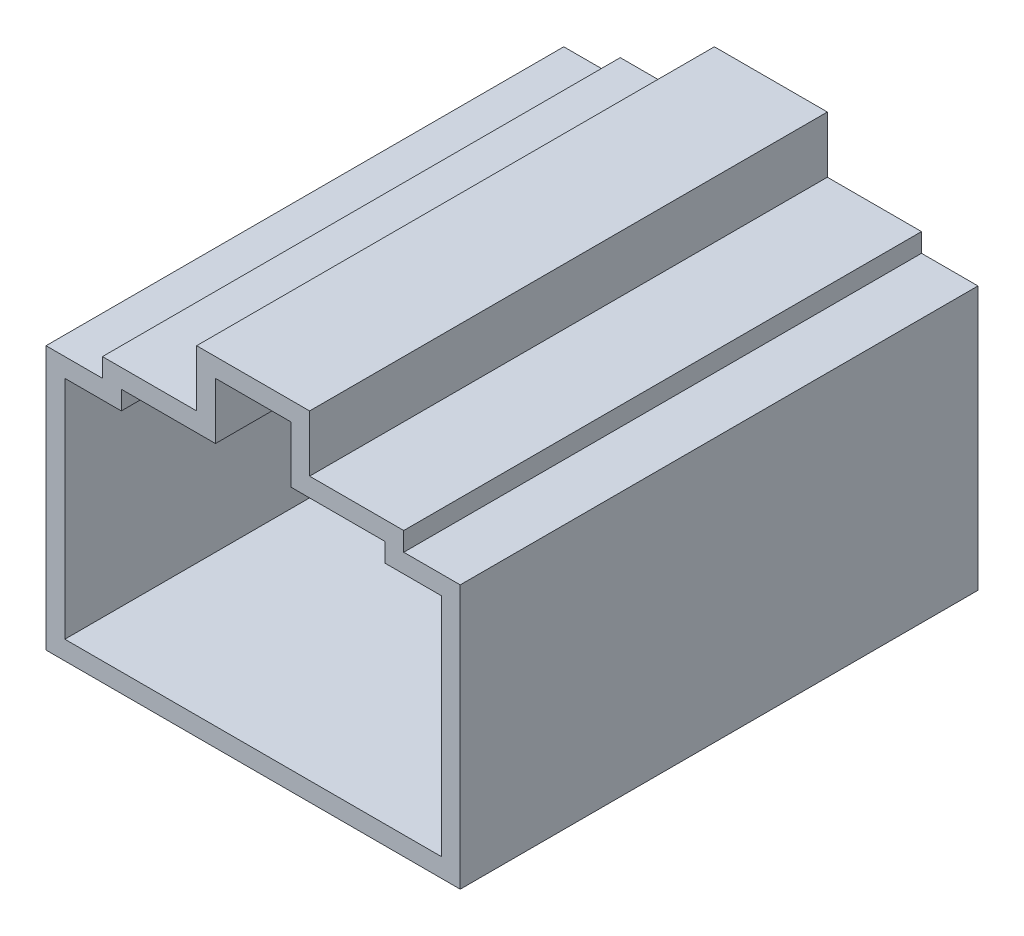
ISO-10303-21;
HEADER;
FILE_DESCRIPTION(('STEP AP214'),'2;1');
FILE_NAME('part.step','',(''),(''),'','','');
FILE_SCHEMA(('AUTOMOTIVE_DESIGN { 1 0 10303 214 1 1 1 1 }'));
ENDSEC;
DATA;
#1=APPLICATION_CONTEXT('core data for automotive mechanical design processes');
#2=APPLICATION_PROTOCOL_DEFINITION('international standard','automotive_design',2000,#1);
#3=PRODUCT_CONTEXT('',#1,'mechanical');
#4=PRODUCT('Part','Part','',(#3));
#5=PRODUCT_RELATED_PRODUCT_CATEGORY('part','',(#4));
#6=PRODUCT_DEFINITION_FORMATION('','',#4);
#7=PRODUCT_DEFINITION_CONTEXT('part definition',#1,'design');
#8=PRODUCT_DEFINITION('design','',#6,#7);
#9=PRODUCT_DEFINITION_SHAPE('','',#8);
#10=(LENGTH_UNIT() NAMED_UNIT(*) SI_UNIT(.MILLI.,.METRE.));
#11=(NAMED_UNIT(*) PLANE_ANGLE_UNIT() SI_UNIT($,.RADIAN.));
#12=(NAMED_UNIT(*) SI_UNIT($,.STERADIAN.) SOLID_ANGLE_UNIT());
#13=UNCERTAINTY_MEASURE_WITH_UNIT(LENGTH_MEASURE(1.E-05),#10,'distance_accuracy_value','');
#14=(GEOMETRIC_REPRESENTATION_CONTEXT(3) GLOBAL_UNCERTAINTY_ASSIGNED_CONTEXT((#13)) GLOBAL_UNIT_ASSIGNED_CONTEXT((#10,
#11,#12)) REPRESENTATION_CONTEXT('',''));
#15=CARTESIAN_POINT('',(0.,0.,0.));
#16=DIRECTION('',(0.,0.,1.));
#17=DIRECTION('',(1.,0.,0.));
#18=AXIS2_PLACEMENT_3D('',#15,#16,#17);
#19=CARTESIAN_POINT('',(0.,0.,27.5));
#20=DIRECTION('',(0.,0.,-1.));
#21=DIRECTION('',(-1.,0.,0.));
#22=AXIS2_PLACEMENT_3D('',#19,#20,#21);
#23=PLANE('',#22);
#24=DIRECTION('',(0.,-1.,0.));
#25=VECTOR('',#24,1.);
#26=CARTESIAN_POINT('',(-12.25,-11.1212765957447,27.5));
#27=LINE('',#26,#25);
#28=CARTESIAN_POINT('',(-12.25,2.87872340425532,27.5));
#29=VERTEX_POINT('',#28);
#30=CARTESIAN_POINT('',(-12.25,-11.1212765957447,27.5));
#31=VERTEX_POINT('',#30);
#32=EDGE_CURVE('E287',#29,#31,#27,.T.);
#33=ORIENTED_EDGE('',*,*,#32,.T.);
#34=DIRECTION('',(1.,0.,0.));
#35=VECTOR('',#34,1.);
#36=CARTESIAN_POINT('',(9.75,-11.1212765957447,27.5));
#37=LINE('',#36,#35);
#38=CARTESIAN_POINT('',(9.75,-11.1212765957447,27.5));
#39=VERTEX_POINT('',#38);
#40=EDGE_CURVE('E290',#31,#39,#37,.T.);
#41=ORIENTED_EDGE('',*,*,#40,.T.);
#42=DIRECTION('',(0.,1.,0.));
#43=VECTOR('',#42,1.);
#44=CARTESIAN_POINT('',(9.75,-11.1212765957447,27.5));
#45=LINE('',#44,#43);
#46=CARTESIAN_POINT('',(9.75,2.87872340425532,27.5));
#47=VERTEX_POINT('',#46);
#48=EDGE_CURVE('E293',#39,#47,#45,.T.);
#49=ORIENTED_EDGE('',*,*,#48,.T.);
#50=DIRECTION('',(-1.,0.,0.));
#51=VECTOR('',#50,1.);
#52=CARTESIAN_POINT('',(9.75,2.87872340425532,27.5));
#53=LINE('',#52,#51);
#54=CARTESIAN_POINT('',(6.75,2.87872340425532,27.5));
#55=VERTEX_POINT('',#54);
#56=EDGE_CURVE('E295',#47,#55,#53,.T.);
#57=ORIENTED_EDGE('',*,*,#56,.T.);
#58=DIRECTION('',(0.,1.,0.));
#59=VECTOR('',#58,1.);
#60=CARTESIAN_POINT('',(6.75,2.87872340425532,27.5));
#61=LINE('',#60,#59);
#62=CARTESIAN_POINT('',(6.75,3.87872340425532,27.5));
#63=VERTEX_POINT('',#62);
#64=EDGE_CURVE('E297',#55,#63,#61,.T.);
#65=ORIENTED_EDGE('',*,*,#64,.T.);
#66=DIRECTION('',(-1.,0.,0.));
#67=VECTOR('',#66,1.);
#68=CARTESIAN_POINT('',(6.75,3.87872340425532,27.5));
#69=LINE('',#68,#67);
#70=CARTESIAN_POINT('',(1.75,3.87872340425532,27.5));
#71=VERTEX_POINT('',#70);
#72=EDGE_CURVE('E299',#63,#71,#69,.T.);
#73=ORIENTED_EDGE('',*,*,#72,.T.);
#74=DIRECTION('',(0.,1.,0.));
#75=VECTOR('',#74,1.);
#76=CARTESIAN_POINT('',(1.75,3.87872340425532,27.5));
#77=LINE('',#76,#75);
#78=CARTESIAN_POINT('',(1.75,6.87872340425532,27.5));
#79=VERTEX_POINT('',#78);
#80=EDGE_CURVE('E301',#71,#79,#77,.T.);
#81=ORIENTED_EDGE('',*,*,#80,.T.);
#82=DIRECTION('',(-1.,0.,0.));
#83=VECTOR('',#82,1.);
#84=CARTESIAN_POINT('',(-4.25,6.87872340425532,27.5));
#85=LINE('',#84,#83);
#86=CARTESIAN_POINT('',(-4.25,6.87872340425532,27.5));
#87=VERTEX_POINT('',#86);
#88=EDGE_CURVE('E303',#79,#87,#85,.T.);
#89=ORIENTED_EDGE('',*,*,#88,.T.);
#90=DIRECTION('',(0.,-1.,0.));
#91=VECTOR('',#90,1.);
#92=CARTESIAN_POINT('',(-4.25,3.87872340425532,27.5));
#93=LINE('',#92,#91);
#94=CARTESIAN_POINT('',(-4.25,3.87872340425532,27.5));
#95=VERTEX_POINT('',#94);
#96=EDGE_CURVE('E305',#87,#95,#93,.T.);
#97=ORIENTED_EDGE('',*,*,#96,.T.);
#98=DIRECTION('',(-1.,0.,0.));
#99=VECTOR('',#98,1.);
#100=CARTESIAN_POINT('',(-9.25,3.87872340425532,27.5));
#101=LINE('',#100,#99);
#102=CARTESIAN_POINT('',(-9.25,3.87872340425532,27.5));
#103=VERTEX_POINT('',#102);
#104=EDGE_CURVE('E307',#95,#103,#101,.T.);
#105=ORIENTED_EDGE('',*,*,#104,.T.);
#106=DIRECTION('',(0.,-1.,0.));
#107=VECTOR('',#106,1.);
#108=CARTESIAN_POINT('',(-9.25,2.87872340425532,27.5));
#109=LINE('',#108,#107);
#110=CARTESIAN_POINT('',(-9.25,2.87872340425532,27.5));
#111=VERTEX_POINT('',#110);
#112=EDGE_CURVE('E309',#103,#111,#109,.T.);
#113=ORIENTED_EDGE('',*,*,#112,.T.);
#114=DIRECTION('',(-1.,0.,0.));
#115=VECTOR('',#114,1.);
#116=CARTESIAN_POINT('',(-12.25,2.87872340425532,27.5));
#117=LINE('',#116,#115);
#118=EDGE_CURVE('E311',#111,#29,#117,.T.);
#119=ORIENTED_EDGE('',*,*,#118,.T.);
#120=EDGE_LOOP('',(#33,#41,#49,#57,#65,#73,#81,#89,#97,#105,#113,#119));
#121=FACE_BOUND('',#120,.T.);
#122=DIRECTION('',(0.,1.,0.));
#123=VECTOR('',#122,1.);
#124=CARTESIAN_POINT('',(8.75,-10.1212765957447,27.5));
#125=LINE('',#124,#123);
#126=CARTESIAN_POINT('',(8.75,-10.1212765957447,27.5));
#127=VERTEX_POINT('',#126);
#128=CARTESIAN_POINT('',(8.75,1.87872340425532,27.5));
#129=VERTEX_POINT('',#128);
#130=EDGE_CURVE('E194',#127,#129,#125,.T.);
#131=ORIENTED_EDGE('',*,*,#130,.F.);
#132=DIRECTION('',(1.,0.,0.));
#133=VECTOR('',#132,1.);
#134=CARTESIAN_POINT('',(8.75,-10.1212765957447,27.5));
#135=LINE('',#134,#133);
#136=CARTESIAN_POINT('',(-11.25,-10.1212765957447,27.5));
#137=VERTEX_POINT('',#136);
#138=EDGE_CURVE('E235',#137,#127,#135,.T.);
#139=ORIENTED_EDGE('',*,*,#138,.F.);
#140=DIRECTION('',(0.,-1.,0.));
#141=VECTOR('',#140,1.);
#142=CARTESIAN_POINT('',(-11.25,-10.1212765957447,27.5));
#143=LINE('',#142,#141);
#144=CARTESIAN_POINT('',(-11.25,1.87872340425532,27.5));
#145=VERTEX_POINT('',#144);
#146=EDGE_CURVE('E233',#145,#137,#143,.T.);
#147=ORIENTED_EDGE('',*,*,#146,.F.);
#148=DIRECTION('',(-1.,0.,0.));
#149=VECTOR('',#148,1.);
#150=CARTESIAN_POINT('',(-11.25,1.87872340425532,27.5));
#151=LINE('',#150,#149);
#152=CARTESIAN_POINT('',(-8.25,1.87872340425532,27.5));
#153=VERTEX_POINT('',#152);
#154=EDGE_CURVE('E231',#153,#145,#151,.T.);
#155=ORIENTED_EDGE('',*,*,#154,.F.);
#156=DIRECTION('',(0.,-1.,0.));
#157=VECTOR('',#156,1.);
#158=CARTESIAN_POINT('',(-8.25,1.87872340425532,27.5));
#159=LINE('',#158,#157);
#160=CARTESIAN_POINT('',(-8.25,2.87872340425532,27.5));
#161=VERTEX_POINT('',#160);
#162=EDGE_CURVE('E229',#161,#153,#159,.T.);
#163=ORIENTED_EDGE('',*,*,#162,.F.);
#164=DIRECTION('',(-1.,0.,0.));
#165=VECTOR('',#164,1.);
#166=CARTESIAN_POINT('',(-8.25,2.87872340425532,27.5));
#167=LINE('',#166,#165);
#168=CARTESIAN_POINT('',(-3.25,2.87872340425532,27.5));
#169=VERTEX_POINT('',#168);
#170=EDGE_CURVE('E227',#169,#161,#167,.T.);
#171=ORIENTED_EDGE('',*,*,#170,.F.);
#172=DIRECTION('',(0.,-1.,0.));
#173=VECTOR('',#172,1.);
#174=CARTESIAN_POINT('',(-3.25,2.87872340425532,27.5));
#175=LINE('',#174,#173);
#176=CARTESIAN_POINT('',(-3.25,5.87872340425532,27.5));
#177=VERTEX_POINT('',#176);
#178=EDGE_CURVE('E225',#177,#169,#175,.T.);
#179=ORIENTED_EDGE('',*,*,#178,.F.);
#180=DIRECTION('',(-1.,0.,0.));
#181=VECTOR('',#180,1.);
#182=CARTESIAN_POINT('',(-3.25,5.87872340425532,27.5));
#183=LINE('',#182,#181);
#184=CARTESIAN_POINT('',(0.750000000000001,5.87872340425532,27.5));
#185=VERTEX_POINT('',#184);
#186=EDGE_CURVE('E223',#185,#177,#183,.T.);
#187=ORIENTED_EDGE('',*,*,#186,.F.);
#188=DIRECTION('',(0.,1.,0.));
#189=VECTOR('',#188,1.);
#190=CARTESIAN_POINT('',(0.750000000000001,2.87872340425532,27.5));
#191=LINE('',#190,#189);
#192=CARTESIAN_POINT('',(0.750000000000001,2.87872340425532,27.5));
#193=VERTEX_POINT('',#192);
#194=EDGE_CURVE('E221',#193,#185,#191,.T.);
#195=ORIENTED_EDGE('',*,*,#194,.F.);
#196=DIRECTION('',(-1.,0.,0.));
#197=VECTOR('',#196,1.);
#198=CARTESIAN_POINT('',(5.75,2.87872340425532,27.5));
#199=LINE('',#198,#197);
#200=CARTESIAN_POINT('',(5.75,2.87872340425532,27.5));
#201=VERTEX_POINT('',#200);
#202=EDGE_CURVE('E217',#201,#193,#199,.T.);
#203=ORIENTED_EDGE('',*,*,#202,.F.);
#204=DIRECTION('',(0.,1.,0.));
#205=VECTOR('',#204,1.);
#206=CARTESIAN_POINT('',(5.75,1.87872340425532,27.5));
#207=LINE('',#206,#205);
#208=CARTESIAN_POINT('',(5.75,1.87872340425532,27.5));
#209=VERTEX_POINT('',#208);
#210=EDGE_CURVE('E215',#209,#201,#207,.T.);
#211=ORIENTED_EDGE('',*,*,#210,.F.);
#212=DIRECTION('',(-1.,0.,0.));
#213=VECTOR('',#212,1.);
#214=CARTESIAN_POINT('',(8.75,1.87872340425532,27.5));
#215=LINE('',#214,#213);
#216=EDGE_CURVE('E202',#129,#209,#215,.T.);
#217=ORIENTED_EDGE('',*,*,#216,.F.);
#218=EDGE_LOOP('',(#131,#139,#147,#155,#163,#171,#179,#187,#195,#203,#211,#217));
#219=FACE_BOUND('',#218,.T.);
#220=ADVANCED_FACE('F33',(#121,#219),#23,.F.);
#221=CARTESIAN_POINT('',(0.,0.,0.));
#222=DIRECTION('',(0.,0.,-1.));
#223=DIRECTION('',(-1.,0.,0.));
#224=AXIS2_PLACEMENT_3D('',#221,#222,#223);
#225=PLANE('',#224);
#226=DIRECTION('',(0.,-1.,0.));
#227=VECTOR('',#226,1.);
#228=CARTESIAN_POINT('',(-12.25,-11.1212765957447,0.));
#229=LINE('',#228,#227);
#230=CARTESIAN_POINT('',(-12.25,2.87872340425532,0.));
#231=VERTEX_POINT('',#230);
#232=CARTESIAN_POINT('',(-12.25,-11.1212765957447,0.));
#233=VERTEX_POINT('',#232);
#234=EDGE_CURVE('E210',#231,#233,#229,.T.);
#235=ORIENTED_EDGE('',*,*,#234,.F.);
#236=DIRECTION('',(-1.,0.,0.));
#237=VECTOR('',#236,1.);
#238=CARTESIAN_POINT('',(-12.25,2.87872340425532,0.));
#239=LINE('',#238,#237);
#240=CARTESIAN_POINT('',(-9.25,2.87872340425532,0.));
#241=VERTEX_POINT('',#240);
#242=EDGE_CURVE('E291',#241,#231,#239,.T.);
#243=ORIENTED_EDGE('',*,*,#242,.F.);
#244=DIRECTION('',(0.,-1.,0.));
#245=VECTOR('',#244,1.);
#246=CARTESIAN_POINT('',(-9.25,2.87872340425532,0.));
#247=LINE('',#246,#245);
#248=CARTESIAN_POINT('',(-9.25,3.87872340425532,0.));
#249=VERTEX_POINT('',#248);
#250=EDGE_CURVE('E334',#249,#241,#247,.T.);
#251=ORIENTED_EDGE('',*,*,#250,.F.);
#252=DIRECTION('',(-1.,0.,0.));
#253=VECTOR('',#252,1.);
#254=CARTESIAN_POINT('',(-9.25,3.87872340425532,0.));
#255=LINE('',#254,#253);
#256=CARTESIAN_POINT('',(-4.25,3.87872340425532,0.));
#257=VERTEX_POINT('',#256);
#258=EDGE_CURVE('E332',#257,#249,#255,.T.);
#259=ORIENTED_EDGE('',*,*,#258,.F.);
#260=DIRECTION('',(0.,-1.,0.));
#261=VECTOR('',#260,1.);
#262=CARTESIAN_POINT('',(-4.25,3.87872340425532,0.));
#263=LINE('',#262,#261);
#264=CARTESIAN_POINT('',(-4.25,6.87872340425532,0.));
#265=VERTEX_POINT('',#264);
#266=EDGE_CURVE('E330',#265,#257,#263,.T.);
#267=ORIENTED_EDGE('',*,*,#266,.F.);
#268=DIRECTION('',(-1.,0.,0.));
#269=VECTOR('',#268,1.);
#270=CARTESIAN_POINT('',(-4.25,6.87872340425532,0.));
#271=LINE('',#270,#269);
#272=CARTESIAN_POINT('',(1.75,6.87872340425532,0.));
#273=VERTEX_POINT('',#272);
#274=EDGE_CURVE('E328',#273,#265,#271,.T.);
#275=ORIENTED_EDGE('',*,*,#274,.F.);
#276=DIRECTION('',(0.,1.,0.));
#277=VECTOR('',#276,1.);
#278=CARTESIAN_POINT('',(1.75,3.87872340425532,0.));
#279=LINE('',#278,#277);
#280=CARTESIAN_POINT('',(1.75,3.87872340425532,0.));
#281=VERTEX_POINT('',#280);
#282=EDGE_CURVE('E326',#281,#273,#279,.T.);
#283=ORIENTED_EDGE('',*,*,#282,.F.);
#284=DIRECTION('',(-1.,0.,0.));
#285=VECTOR('',#284,1.);
#286=CARTESIAN_POINT('',(6.75,3.87872340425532,0.));
#287=LINE('',#286,#285);
#288=CARTESIAN_POINT('',(6.75,3.87872340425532,0.));
#289=VERTEX_POINT('',#288);
#290=EDGE_CURVE('E324',#289,#281,#287,.T.);
#291=ORIENTED_EDGE('',*,*,#290,.F.);
#292=DIRECTION('',(0.,1.,0.));
#293=VECTOR('',#292,1.);
#294=CARTESIAN_POINT('',(6.75,2.87872340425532,0.));
#295=LINE('',#294,#293);
#296=CARTESIAN_POINT('',(6.75,2.87872340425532,0.));
#297=VERTEX_POINT('',#296);
#298=EDGE_CURVE('E322',#297,#289,#295,.T.);
#299=ORIENTED_EDGE('',*,*,#298,.F.);
#300=DIRECTION('',(-1.,0.,0.));
#301=VECTOR('',#300,1.);
#302=CARTESIAN_POINT('',(9.75,2.87872340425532,0.));
#303=LINE('',#302,#301);
#304=CARTESIAN_POINT('',(9.75,2.87872340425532,0.));
#305=VERTEX_POINT('',#304);
#306=EDGE_CURVE('E320',#305,#297,#303,.T.);
#307=ORIENTED_EDGE('',*,*,#306,.F.);
#308=DIRECTION('',(0.,1.,0.));
#309=VECTOR('',#308,1.);
#310=CARTESIAN_POINT('',(9.75,-11.1212765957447,0.));
#311=LINE('',#310,#309);
#312=CARTESIAN_POINT('',(9.75,-11.1212765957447,0.));
#313=VERTEX_POINT('',#312);
#314=EDGE_CURVE('E318',#313,#305,#311,.T.);
#315=ORIENTED_EDGE('',*,*,#314,.F.);
#316=DIRECTION('',(1.,0.,0.));
#317=VECTOR('',#316,1.);
#318=CARTESIAN_POINT('',(9.75,-11.1212765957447,0.));
#319=LINE('',#318,#317);
#320=EDGE_CURVE('E316',#233,#313,#319,.T.);
#321=ORIENTED_EDGE('',*,*,#320,.F.);
#322=EDGE_LOOP('',(#235,#243,#251,#259,#267,#275,#283,#291,#299,#307,#315,#321));
#323=FACE_BOUND('',#322,.T.);
#324=DIRECTION('',(1.,0.,0.));
#325=VECTOR('',#324,1.);
#326=CARTESIAN_POINT('',(8.75,-10.1212765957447,0.));
#327=LINE('',#326,#325);
#328=CARTESIAN_POINT('',(-11.25,-10.1212765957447,0.));
#329=VERTEX_POINT('',#328);
#330=CARTESIAN_POINT('',(8.75,-10.1212765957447,0.));
#331=VERTEX_POINT('',#330);
#332=EDGE_CURVE('E203',#329,#331,#327,.T.);
#333=ORIENTED_EDGE('',*,*,#332,.T.);
#334=DIRECTION('',(0.,1.,0.));
#335=VECTOR('',#334,1.);
#336=CARTESIAN_POINT('',(8.75,-10.1212765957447,0.));
#337=LINE('',#336,#335);
#338=CARTESIAN_POINT('',(8.75,1.87872340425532,0.));
#339=VERTEX_POINT('',#338);
#340=EDGE_CURVE('E56',#331,#339,#337,.T.);
#341=ORIENTED_EDGE('',*,*,#340,.T.);
#342=DIRECTION('',(-1.,0.,0.));
#343=VECTOR('',#342,1.);
#344=CARTESIAN_POINT('',(8.75,1.87872340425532,0.));
#345=LINE('',#344,#343);
#346=CARTESIAN_POINT('',(5.75,1.87872340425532,0.));
#347=VERTEX_POINT('',#346);
#348=EDGE_CURVE('E209',#339,#347,#345,.T.);
#349=ORIENTED_EDGE('',*,*,#348,.T.);
#350=DIRECTION('',(0.,1.,0.));
#351=VECTOR('',#350,1.);
#352=CARTESIAN_POINT('',(5.75,1.87872340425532,0.));
#353=LINE('',#352,#351);
#354=CARTESIAN_POINT('',(5.75,2.87872340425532,0.));
#355=VERTEX_POINT('',#354);
#356=EDGE_CURVE('E239',#347,#355,#353,.T.);
#357=ORIENTED_EDGE('',*,*,#356,.T.);
#358=DIRECTION('',(-1.,0.,0.));
#359=VECTOR('',#358,1.);
#360=CARTESIAN_POINT('',(5.75,2.87872340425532,0.));
#361=LINE('',#360,#359);
#362=CARTESIAN_POINT('',(0.750000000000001,2.87872340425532,0.));
#363=VERTEX_POINT('',#362);
#364=EDGE_CURVE('E242',#355,#363,#361,.T.);
#365=ORIENTED_EDGE('',*,*,#364,.T.);
#366=DIRECTION('',(0.,1.,0.));
#367=VECTOR('',#366,1.);
#368=CARTESIAN_POINT('',(0.750000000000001,2.87872340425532,0.));
#369=LINE('',#368,#367);
#370=CARTESIAN_POINT('',(0.750000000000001,5.87872340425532,0.));
#371=VERTEX_POINT('',#370);
#372=EDGE_CURVE('E245',#363,#371,#369,.T.);
#373=ORIENTED_EDGE('',*,*,#372,.T.);
#374=DIRECTION('',(-1.,0.,0.));
#375=VECTOR('',#374,1.);
#376=CARTESIAN_POINT('',(-3.25,5.87872340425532,0.));
#377=LINE('',#376,#375);
#378=CARTESIAN_POINT('',(-3.25,5.87872340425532,0.));
#379=VERTEX_POINT('',#378);
#380=EDGE_CURVE('E248',#371,#379,#377,.T.);
#381=ORIENTED_EDGE('',*,*,#380,.T.);
#382=DIRECTION('',(0.,-1.,0.));
#383=VECTOR('',#382,1.);
#384=CARTESIAN_POINT('',(-3.25,2.87872340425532,0.));
#385=LINE('',#384,#383);
#386=CARTESIAN_POINT('',(-3.25,2.87872340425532,0.));
#387=VERTEX_POINT('',#386);
#388=EDGE_CURVE('E251',#379,#387,#385,.T.);
#389=ORIENTED_EDGE('',*,*,#388,.T.);
#390=DIRECTION('',(-1.,0.,0.));
#391=VECTOR('',#390,1.);
#392=CARTESIAN_POINT('',(-8.25,2.87872340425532,0.));
#393=LINE('',#392,#391);
#394=CARTESIAN_POINT('',(-8.25,2.87872340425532,0.));
#395=VERTEX_POINT('',#394);
#396=EDGE_CURVE('E254',#387,#395,#393,.T.);
#397=ORIENTED_EDGE('',*,*,#396,.T.);
#398=DIRECTION('',(0.,-1.,0.));
#399=VECTOR('',#398,1.);
#400=CARTESIAN_POINT('',(-8.25,1.87872340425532,0.));
#401=LINE('',#400,#399);
#402=CARTESIAN_POINT('',(-8.25,1.87872340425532,0.));
#403=VERTEX_POINT('',#402);
#404=EDGE_CURVE('E257',#395,#403,#401,.T.);
#405=ORIENTED_EDGE('',*,*,#404,.T.);
#406=DIRECTION('',(-1.,0.,0.));
#407=VECTOR('',#406,1.);
#408=CARTESIAN_POINT('',(-11.25,1.87872340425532,0.));
#409=LINE('',#408,#407);
#410=CARTESIAN_POINT('',(-11.25,1.87872340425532,0.));
#411=VERTEX_POINT('',#410);
#412=EDGE_CURVE('E260',#403,#411,#409,.T.);
#413=ORIENTED_EDGE('',*,*,#412,.T.);
#414=DIRECTION('',(0.,-1.,0.));
#415=VECTOR('',#414,1.);
#416=CARTESIAN_POINT('',(-11.25,-10.1212765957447,0.));
#417=LINE('',#416,#415);
#418=EDGE_CURVE('E263',#411,#329,#417,.T.);
#419=ORIENTED_EDGE('',*,*,#418,.T.);
#420=EDGE_LOOP('',(#333,#341,#349,#357,#365,#373,#381,#389,#397,#405,#413,#419));
#421=FACE_BOUND('',#420,.T.);
#422=ADVANCED_FACE('F376',(#323,#421),#225,.T.);
#423=CARTESIAN_POINT('',(-12.25,-11.1212765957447,27.5));
#424=DIRECTION('',(1.,0.,0.));
#425=DIRECTION('',(0.,0.,-1.));
#426=AXIS2_PLACEMENT_3D('',#423,#424,#425);
#427=PLANE('',#426);
#428=ORIENTED_EDGE('',*,*,#234,.T.);
#429=DIRECTION('',(0.,0.,-1.));
#430=VECTOR('',#429,1.);
#431=CARTESIAN_POINT('',(-12.25,-11.1212765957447,27.5));
#432=LINE('',#431,#430);
#433=EDGE_CURVE('E11',#31,#233,#432,.T.);
#434=ORIENTED_EDGE('',*,*,#433,.F.);
#435=ORIENTED_EDGE('',*,*,#32,.F.);
#436=DIRECTION('',(0.,0.,-1.));
#437=VECTOR('',#436,1.);
#438=CARTESIAN_POINT('',(-12.25,2.87872340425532,27.5));
#439=LINE('',#438,#437);
#440=EDGE_CURVE('E313',#29,#231,#439,.T.);
#441=ORIENTED_EDGE('',*,*,#440,.T.);
#442=EDGE_LOOP('',(#428,#434,#435,#441));
#443=FACE_BOUND('',#442,.T.);
#444=ADVANCED_FACE('F35',(#443),#427,.F.);
#445=CARTESIAN_POINT('',(9.75,-11.1212765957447,27.5));
#446=DIRECTION('',(0.,1.,0.));
#447=DIRECTION('',(0.,0.,1.));
#448=AXIS2_PLACEMENT_3D('',#445,#446,#447);
#449=PLANE('',#448);
#450=ORIENTED_EDGE('',*,*,#320,.T.);
#451=DIRECTION('',(0.,0.,-1.));
#452=VECTOR('',#451,1.);
#453=CARTESIAN_POINT('',(9.75,-11.1212765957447,27.5));
#454=LINE('',#453,#452);
#455=EDGE_CURVE('E41',#39,#313,#454,.T.);
#456=ORIENTED_EDGE('',*,*,#455,.F.);
#457=ORIENTED_EDGE('',*,*,#40,.F.);
#458=ORIENTED_EDGE('',*,*,#433,.T.);
#459=EDGE_LOOP('',(#450,#456,#457,#458));
#460=FACE_BOUND('',#459,.T.);
#461=ADVANCED_FACE('F393',(#460),#449,.F.);
#462=CARTESIAN_POINT('',(9.75,-11.1212765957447,27.5));
#463=DIRECTION('',(-1.,0.,0.));
#464=DIRECTION('',(0.,0.,1.));
#465=AXIS2_PLACEMENT_3D('',#462,#463,#464);
#466=PLANE('',#465);
#467=ORIENTED_EDGE('',*,*,#314,.T.);
#468=DIRECTION('',(0.,0.,-1.));
#469=VECTOR('',#468,1.);
#470=CARTESIAN_POINT('',(9.75,2.87872340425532,27.5));
#471=LINE('',#470,#469);
#472=EDGE_CURVE('E363',#47,#305,#471,.T.);
#473=ORIENTED_EDGE('',*,*,#472,.F.);
#474=ORIENTED_EDGE('',*,*,#48,.F.);
#475=ORIENTED_EDGE('',*,*,#455,.T.);
#476=EDGE_LOOP('',(#467,#473,#474,#475));
#477=FACE_BOUND('',#476,.T.);
#478=ADVANCED_FACE('F370',(#477),#466,.F.);
#479=CARTESIAN_POINT('',(9.75,2.87872340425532,27.5));
#480=DIRECTION('',(0.,-1.,0.));
#481=DIRECTION('',(0.,0.,-1.));
#482=AXIS2_PLACEMENT_3D('',#479,#480,#481);
#483=PLANE('',#482);
#484=ORIENTED_EDGE('',*,*,#306,.T.);
#485=DIRECTION('',(0.,0.,-1.));
#486=VECTOR('',#485,1.);
#487=CARTESIAN_POINT('',(6.75,2.87872340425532,27.5));
#488=LINE('',#487,#486);
#489=EDGE_CURVE('E360',#55,#297,#488,.T.);
#490=ORIENTED_EDGE('',*,*,#489,.F.);
#491=ORIENTED_EDGE('',*,*,#56,.F.);
#492=ORIENTED_EDGE('',*,*,#472,.T.);
#493=EDGE_LOOP('',(#484,#490,#491,#492));
#494=FACE_BOUND('',#493,.T.);
#495=ADVANCED_FACE('F382',(#494),#483,.F.);
#496=CARTESIAN_POINT('',(6.75,2.87872340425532,27.5));
#497=DIRECTION('',(-1.,0.,0.));
#498=DIRECTION('',(0.,-1.,0.));
#499=AXIS2_PLACEMENT_3D('',#496,#497,#498);
#500=PLANE('',#499);
#501=ORIENTED_EDGE('',*,*,#298,.T.);
#502=DIRECTION('',(0.,0.,-1.));
#503=VECTOR('',#502,1.);
#504=CARTESIAN_POINT('',(6.75,3.87872340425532,27.5));
#505=LINE('',#504,#503);
#506=EDGE_CURVE('E357',#63,#289,#505,.T.);
#507=ORIENTED_EDGE('',*,*,#506,.F.);
#508=ORIENTED_EDGE('',*,*,#64,.F.);
#509=ORIENTED_EDGE('',*,*,#489,.T.);
#510=EDGE_LOOP('',(#501,#507,#508,#509));
#511=FACE_BOUND('',#510,.T.);
#512=ADVANCED_FACE('F386',(#511),#500,.F.);
#513=CARTESIAN_POINT('',(6.75,3.87872340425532,27.5));
#514=DIRECTION('',(0.,-1.,0.));
#515=DIRECTION('',(1.,0.,0.));
#516=AXIS2_PLACEMENT_3D('',#513,#514,#515);
#517=PLANE('',#516);
#518=ORIENTED_EDGE('',*,*,#290,.T.);
#519=DIRECTION('',(0.,0.,-1.));
#520=VECTOR('',#519,1.);
#521=CARTESIAN_POINT('',(1.75,3.87872340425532,27.5));
#522=LINE('',#521,#520);
#523=EDGE_CURVE('E354',#71,#281,#522,.T.);
#524=ORIENTED_EDGE('',*,*,#523,.F.);
#525=ORIENTED_EDGE('',*,*,#72,.F.);
#526=ORIENTED_EDGE('',*,*,#506,.T.);
#527=EDGE_LOOP('',(#518,#524,#525,#526));
#528=FACE_BOUND('',#527,.T.);
#529=ADVANCED_FACE('F426',(#528),#517,.F.);
#530=CARTESIAN_POINT('',(1.75,3.87872340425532,27.5));
#531=DIRECTION('',(-1.,0.,0.));
#532=DIRECTION('',(0.,-1.,0.));
#533=AXIS2_PLACEMENT_3D('',#530,#531,#532);
#534=PLANE('',#533);
#535=ORIENTED_EDGE('',*,*,#282,.T.);
#536=DIRECTION('',(0.,0.,-1.));
#537=VECTOR('',#536,1.);
#538=CARTESIAN_POINT('',(1.75,6.87872340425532,27.5));
#539=LINE('',#538,#537);
#540=EDGE_CURVE('E351',#79,#273,#539,.T.);
#541=ORIENTED_EDGE('',*,*,#540,.F.);
#542=ORIENTED_EDGE('',*,*,#80,.F.);
#543=ORIENTED_EDGE('',*,*,#523,.T.);
#544=EDGE_LOOP('',(#535,#541,#542,#543));
#545=FACE_BOUND('',#544,.T.);
#546=ADVANCED_FACE('F424',(#545),#534,.F.);
#547=CARTESIAN_POINT('',(-4.25,6.87872340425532,27.5));
#548=DIRECTION('',(0.,-1.,0.));
#549=DIRECTION('',(0.,0.,-1.));
#550=AXIS2_PLACEMENT_3D('',#547,#548,#549);
#551=PLANE('',#550);
#552=ORIENTED_EDGE('',*,*,#274,.T.);
#553=DIRECTION('',(0.,0.,-1.));
#554=VECTOR('',#553,1.);
#555=CARTESIAN_POINT('',(-4.25,6.87872340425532,27.5));
#556=LINE('',#555,#554);
#557=EDGE_CURVE('E348',#87,#265,#556,.T.);
#558=ORIENTED_EDGE('',*,*,#557,.F.);
#559=ORIENTED_EDGE('',*,*,#88,.F.);
#560=ORIENTED_EDGE('',*,*,#540,.T.);
#561=EDGE_LOOP('',(#552,#558,#559,#560));
#562=FACE_BOUND('',#561,.T.);
#563=ADVANCED_FACE('F420',(#562),#551,.F.);
#564=CARTESIAN_POINT('',(-4.25,3.87872340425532,27.5));
#565=DIRECTION('',(1.,0.,0.));
#566=DIRECTION('',(0.,1.,0.));
#567=AXIS2_PLACEMENT_3D('',#564,#565,#566);
#568=PLANE('',#567);
#569=ORIENTED_EDGE('',*,*,#266,.T.);
#570=DIRECTION('',(0.,0.,-1.));
#571=VECTOR('',#570,1.);
#572=CARTESIAN_POINT('',(-4.25,3.87872340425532,27.5));
#573=LINE('',#572,#571);
#574=EDGE_CURVE('E345',#95,#257,#573,.T.);
#575=ORIENTED_EDGE('',*,*,#574,.F.);
#576=ORIENTED_EDGE('',*,*,#96,.F.);
#577=ORIENTED_EDGE('',*,*,#557,.T.);
#578=EDGE_LOOP('',(#569,#575,#576,#577));
#579=FACE_BOUND('',#578,.T.);
#580=ADVANCED_FACE('F415',(#579),#568,.F.);
#581=CARTESIAN_POINT('',(-9.25,3.87872340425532,27.5));
#582=DIRECTION('',(0.,-1.,0.));
#583=DIRECTION('',(1.,0.,0.));
#584=AXIS2_PLACEMENT_3D('',#581,#582,#583);
#585=PLANE('',#584);
#586=ORIENTED_EDGE('',*,*,#258,.T.);
#587=DIRECTION('',(0.,0.,-1.));
#588=VECTOR('',#587,1.);
#589=CARTESIAN_POINT('',(-9.25,3.87872340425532,27.5));
#590=LINE('',#589,#588);
#591=EDGE_CURVE('E342',#103,#249,#590,.T.);
#592=ORIENTED_EDGE('',*,*,#591,.F.);
#593=ORIENTED_EDGE('',*,*,#104,.F.);
#594=ORIENTED_EDGE('',*,*,#574,.T.);
#595=EDGE_LOOP('',(#586,#592,#593,#594));
#596=FACE_BOUND('',#595,.T.);
#597=ADVANCED_FACE('F409',(#596),#585,.F.);
#598=CARTESIAN_POINT('',(-9.25,2.87872340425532,27.5));
#599=DIRECTION('',(1.,0.,0.));
#600=DIRECTION('',(0.,1.,0.));
#601=AXIS2_PLACEMENT_3D('',#598,#599,#600);
#602=PLANE('',#601);
#603=ORIENTED_EDGE('',*,*,#250,.T.);
#604=DIRECTION('',(0.,0.,-1.));
#605=VECTOR('',#604,1.);
#606=CARTESIAN_POINT('',(-9.25,2.87872340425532,27.5));
#607=LINE('',#606,#605);
#608=EDGE_CURVE('E339',#111,#241,#607,.T.);
#609=ORIENTED_EDGE('',*,*,#608,.F.);
#610=ORIENTED_EDGE('',*,*,#112,.F.);
#611=ORIENTED_EDGE('',*,*,#591,.T.);
#612=EDGE_LOOP('',(#603,#609,#610,#611));
#613=FACE_BOUND('',#612,.T.);
#614=ADVANCED_FACE('F405',(#613),#602,.F.);
#615=CARTESIAN_POINT('',(-12.25,2.87872340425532,27.5));
#616=DIRECTION('',(0.,-1.,0.));
#617=DIRECTION('',(0.,0.,-1.));
#618=AXIS2_PLACEMENT_3D('',#615,#616,#617);
#619=PLANE('',#618);
#620=ORIENTED_EDGE('',*,*,#242,.T.);
#621=ORIENTED_EDGE('',*,*,#440,.F.);
#622=ORIENTED_EDGE('',*,*,#118,.F.);
#623=ORIENTED_EDGE('',*,*,#608,.T.);
#624=EDGE_LOOP('',(#620,#621,#622,#623));
#625=FACE_BOUND('',#624,.T.);
#626=ADVANCED_FACE('F400',(#625),#619,.F.);
#627=CARTESIAN_POINT('',(8.75,-10.1212765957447,27.5));
#628=DIRECTION('',(-1.,0.,0.));
#629=DIRECTION('',(0.,0.,1.));
#630=AXIS2_PLACEMENT_3D('',#627,#628,#629);
#631=PLANE('',#630);
#632=ORIENTED_EDGE('',*,*,#340,.F.);
#633=DIRECTION('',(0.,0.,-1.));
#634=VECTOR('',#633,1.);
#635=CARTESIAN_POINT('',(8.75,-10.1212765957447,27.5));
#636=LINE('',#635,#634);
#637=EDGE_CURVE('E198',#127,#331,#636,.T.);
#638=ORIENTED_EDGE('',*,*,#637,.F.);
#639=ORIENTED_EDGE('',*,*,#130,.T.);
#640=DIRECTION('',(0.,0.,-1.));
#641=VECTOR('',#640,1.);
#642=CARTESIAN_POINT('',(8.75,1.87872340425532,27.5));
#643=LINE('',#642,#641);
#644=EDGE_CURVE('E197',#129,#339,#643,.T.);
#645=ORIENTED_EDGE('',*,*,#644,.T.);
#646=EDGE_LOOP('',(#632,#638,#639,#645));
#647=FACE_BOUND('',#646,.T.);
#648=ADVANCED_FACE('F196',(#647),#631,.T.);
#649=CARTESIAN_POINT('',(8.75,1.87872340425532,27.5));
#650=DIRECTION('',(0.,-1.,0.));
#651=DIRECTION('',(1.,0.,0.));
#652=AXIS2_PLACEMENT_3D('',#649,#650,#651);
#653=PLANE('',#652);
#654=ORIENTED_EDGE('',*,*,#348,.F.);
#655=ORIENTED_EDGE('',*,*,#644,.F.);
#656=ORIENTED_EDGE('',*,*,#216,.T.);
#657=DIRECTION('',(0.,0.,-1.));
#658=VECTOR('',#657,1.);
#659=CARTESIAN_POINT('',(5.75,1.87872340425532,27.5));
#660=LINE('',#659,#658);
#661=EDGE_CURVE('E211',#209,#347,#660,.T.);
#662=ORIENTED_EDGE('',*,*,#661,.T.);
#663=EDGE_LOOP('',(#654,#655,#656,#662));
#664=FACE_BOUND('',#663,.T.);
#665=ADVANCED_FACE('F206',(#664),#653,.T.);
#666=CARTESIAN_POINT('',(5.75,1.87872340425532,27.5));
#667=DIRECTION('',(-1.,0.,0.));
#668=DIRECTION('',(0.,0.,1.));
#669=AXIS2_PLACEMENT_3D('',#666,#667,#668);
#670=PLANE('',#669);
#671=ORIENTED_EDGE('',*,*,#356,.F.);
#672=ORIENTED_EDGE('',*,*,#661,.F.);
#673=ORIENTED_EDGE('',*,*,#210,.T.);
#674=DIRECTION('',(0.,0.,-1.));
#675=VECTOR('',#674,1.);
#676=CARTESIAN_POINT('',(5.75,2.87872340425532,27.5));
#677=LINE('',#676,#675);
#678=EDGE_CURVE('E284',#201,#355,#677,.T.);
#679=ORIENTED_EDGE('',*,*,#678,.T.);
#680=EDGE_LOOP('',(#671,#672,#673,#679));
#681=FACE_BOUND('',#680,.T.);
#682=ADVANCED_FACE('F484',(#681),#670,.T.);
#683=CARTESIAN_POINT('',(5.75,2.87872340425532,27.5));
#684=DIRECTION('',(0.,-1.,0.));
#685=DIRECTION('',(0.,0.,-1.));
#686=AXIS2_PLACEMENT_3D('',#683,#684,#685);
#687=PLANE('',#686);
#688=ORIENTED_EDGE('',*,*,#364,.F.);
#689=ORIENTED_EDGE('',*,*,#678,.F.);
#690=ORIENTED_EDGE('',*,*,#202,.T.);
#691=DIRECTION('',(0.,0.,-1.));
#692=VECTOR('',#691,1.);
#693=CARTESIAN_POINT('',(0.750000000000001,2.87872340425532,27.5));
#694=LINE('',#693,#692);
#695=EDGE_CURVE('E282',#193,#363,#694,.T.);
#696=ORIENTED_EDGE('',*,*,#695,.T.);
#697=EDGE_LOOP('',(#688,#689,#690,#696));
#698=FACE_BOUND('',#697,.T.);
#699=ADVANCED_FACE('F490',(#698),#687,.T.);
#700=CARTESIAN_POINT('',(0.750000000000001,2.87872340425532,27.5));
#701=DIRECTION('',(-1.,0.,0.));
#702=DIRECTION('',(0.,0.,1.));
#703=AXIS2_PLACEMENT_3D('',#700,#701,#702);
#704=PLANE('',#703);
#705=ORIENTED_EDGE('',*,*,#372,.F.);
#706=ORIENTED_EDGE('',*,*,#695,.F.);
#707=ORIENTED_EDGE('',*,*,#194,.T.);
#708=DIRECTION('',(0.,0.,-1.));
#709=VECTOR('',#708,1.);
#710=CARTESIAN_POINT('',(0.750000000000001,5.87872340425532,27.5));
#711=LINE('',#710,#709);
#712=EDGE_CURVE('E280',#185,#371,#711,.T.);
#713=ORIENTED_EDGE('',*,*,#712,.T.);
#714=EDGE_LOOP('',(#705,#706,#707,#713));
#715=FACE_BOUND('',#714,.T.);
#716=ADVANCED_FACE('F498',(#715),#704,.T.);
#717=CARTESIAN_POINT('',(-3.25,5.87872340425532,27.5));
#718=DIRECTION('',(0.,-1.,0.));
#719=DIRECTION('',(0.,0.,-1.));
#720=AXIS2_PLACEMENT_3D('',#717,#718,#719);
#721=PLANE('',#720);
#722=ORIENTED_EDGE('',*,*,#380,.F.);
#723=ORIENTED_EDGE('',*,*,#712,.F.);
#724=ORIENTED_EDGE('',*,*,#186,.T.);
#725=DIRECTION('',(0.,0.,-1.));
#726=VECTOR('',#725,1.);
#727=CARTESIAN_POINT('',(-3.25,5.87872340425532,27.5));
#728=LINE('',#727,#726);
#729=EDGE_CURVE('E278',#177,#379,#728,.T.);
#730=ORIENTED_EDGE('',*,*,#729,.T.);
#731=EDGE_LOOP('',(#722,#723,#724,#730));
#732=FACE_BOUND('',#731,.T.);
#733=ADVANCED_FACE('F506',(#732),#721,.T.);
#734=CARTESIAN_POINT('',(-3.25,2.87872340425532,27.5));
#735=DIRECTION('',(1.,0.,0.));
#736=DIRECTION('',(0.,0.,-1.));
#737=AXIS2_PLACEMENT_3D('',#734,#735,#736);
#738=PLANE('',#737);
#739=ORIENTED_EDGE('',*,*,#388,.F.);
#740=ORIENTED_EDGE('',*,*,#729,.F.);
#741=ORIENTED_EDGE('',*,*,#178,.T.);
#742=DIRECTION('',(0.,0.,-1.));
#743=VECTOR('',#742,1.);
#744=CARTESIAN_POINT('',(-3.25,2.87872340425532,27.5));
#745=LINE('',#744,#743);
#746=EDGE_CURVE('E276',#169,#387,#745,.T.);
#747=ORIENTED_EDGE('',*,*,#746,.T.);
#748=EDGE_LOOP('',(#739,#740,#741,#747));
#749=FACE_BOUND('',#748,.T.);
#750=ADVANCED_FACE('F514',(#749),#738,.T.);
#751=CARTESIAN_POINT('',(-8.25,2.87872340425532,27.5));
#752=DIRECTION('',(0.,-1.,0.));
#753=DIRECTION('',(0.,0.,-1.));
#754=AXIS2_PLACEMENT_3D('',#751,#752,#753);
#755=PLANE('',#754);
#756=ORIENTED_EDGE('',*,*,#396,.F.);
#757=ORIENTED_EDGE('',*,*,#746,.F.);
#758=ORIENTED_EDGE('',*,*,#170,.T.);
#759=DIRECTION('',(0.,0.,-1.));
#760=VECTOR('',#759,1.);
#761=CARTESIAN_POINT('',(-8.25,2.87872340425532,27.5));
#762=LINE('',#761,#760);
#763=EDGE_CURVE('E274',#161,#395,#762,.T.);
#764=ORIENTED_EDGE('',*,*,#763,.T.);
#765=EDGE_LOOP('',(#756,#757,#758,#764));
#766=FACE_BOUND('',#765,.T.);
#767=ADVANCED_FACE('F522',(#766),#755,.T.);
#768=CARTESIAN_POINT('',(-8.25,1.87872340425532,27.5));
#769=DIRECTION('',(1.,0.,0.));
#770=DIRECTION('',(0.,0.,-1.));
#771=AXIS2_PLACEMENT_3D('',#768,#769,#770);
#772=PLANE('',#771);
#773=ORIENTED_EDGE('',*,*,#404,.F.);
#774=ORIENTED_EDGE('',*,*,#763,.F.);
#775=ORIENTED_EDGE('',*,*,#162,.T.);
#776=DIRECTION('',(0.,0.,-1.));
#777=VECTOR('',#776,1.);
#778=CARTESIAN_POINT('',(-8.25,1.87872340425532,27.5));
#779=LINE('',#778,#777);
#780=EDGE_CURVE('E272',#153,#403,#779,.T.);
#781=ORIENTED_EDGE('',*,*,#780,.T.);
#782=EDGE_LOOP('',(#773,#774,#775,#781));
#783=FACE_BOUND('',#782,.T.);
#784=ADVANCED_FACE('F530',(#783),#772,.T.);
#785=CARTESIAN_POINT('',(-11.25,1.87872340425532,27.5));
#786=DIRECTION('',(0.,-1.,0.));
#787=DIRECTION('',(0.,0.,-1.));
#788=AXIS2_PLACEMENT_3D('',#785,#786,#787);
#789=PLANE('',#788);
#790=ORIENTED_EDGE('',*,*,#412,.F.);
#791=ORIENTED_EDGE('',*,*,#780,.F.);
#792=ORIENTED_EDGE('',*,*,#154,.T.);
#793=DIRECTION('',(0.,0.,-1.));
#794=VECTOR('',#793,1.);
#795=CARTESIAN_POINT('',(-11.25,1.87872340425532,27.5));
#796=LINE('',#795,#794);
#797=EDGE_CURVE('E270',#145,#411,#796,.T.);
#798=ORIENTED_EDGE('',*,*,#797,.T.);
#799=EDGE_LOOP('',(#790,#791,#792,#798));
#800=FACE_BOUND('',#799,.T.);
#801=ADVANCED_FACE('F538',(#800),#789,.T.);
#802=CARTESIAN_POINT('',(-11.25,-10.1212765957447,27.5));
#803=DIRECTION('',(1.,0.,0.));
#804=DIRECTION('',(0.,0.,-1.));
#805=AXIS2_PLACEMENT_3D('',#802,#803,#804);
#806=PLANE('',#805);
#807=ORIENTED_EDGE('',*,*,#418,.F.);
#808=ORIENTED_EDGE('',*,*,#797,.F.);
#809=ORIENTED_EDGE('',*,*,#146,.T.);
#810=DIRECTION('',(0.,0.,-1.));
#811=VECTOR('',#810,1.);
#812=CARTESIAN_POINT('',(-11.25,-10.1212765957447,27.5));
#813=LINE('',#812,#811);
#814=EDGE_CURVE('E48',#137,#329,#813,.T.);
#815=ORIENTED_EDGE('',*,*,#814,.T.);
#816=EDGE_LOOP('',(#807,#808,#809,#815));
#817=FACE_BOUND('',#816,.T.);
#818=ADVANCED_FACE('F546',(#817),#806,.T.);
#819=CARTESIAN_POINT('',(8.75,-10.1212765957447,27.5));
#820=DIRECTION('',(0.,1.,0.));
#821=DIRECTION('',(0.,0.,1.));
#822=AXIS2_PLACEMENT_3D('',#819,#820,#821);
#823=PLANE('',#822);
#824=ORIENTED_EDGE('',*,*,#332,.F.);
#825=ORIENTED_EDGE('',*,*,#814,.F.);
#826=ORIENTED_EDGE('',*,*,#138,.T.);
#827=ORIENTED_EDGE('',*,*,#637,.T.);
#828=EDGE_LOOP('',(#824,#825,#826,#827));
#829=FACE_BOUND('',#828,.T.);
#830=ADVANCED_FACE('F554',(#829),#823,.T.);
#831=CLOSED_SHELL('',(#220,#422,#444,#461,#478,#495,#512,#529,#546,#563,#580,#597,#614,#626,
#648,#665,#682,#699,#716,#733,#750,#767,#784,#801,#818,#830));
#832=MANIFOLD_SOLID_BREP('B2',#831);
#833=ADVANCED_BREP_SHAPE_REPRESENTATION('',(#18,#832),#14);
#834=SHAPE_DEFINITION_REPRESENTATION(#9,#833);
ENDSEC;
END-ISO-10303-21;
